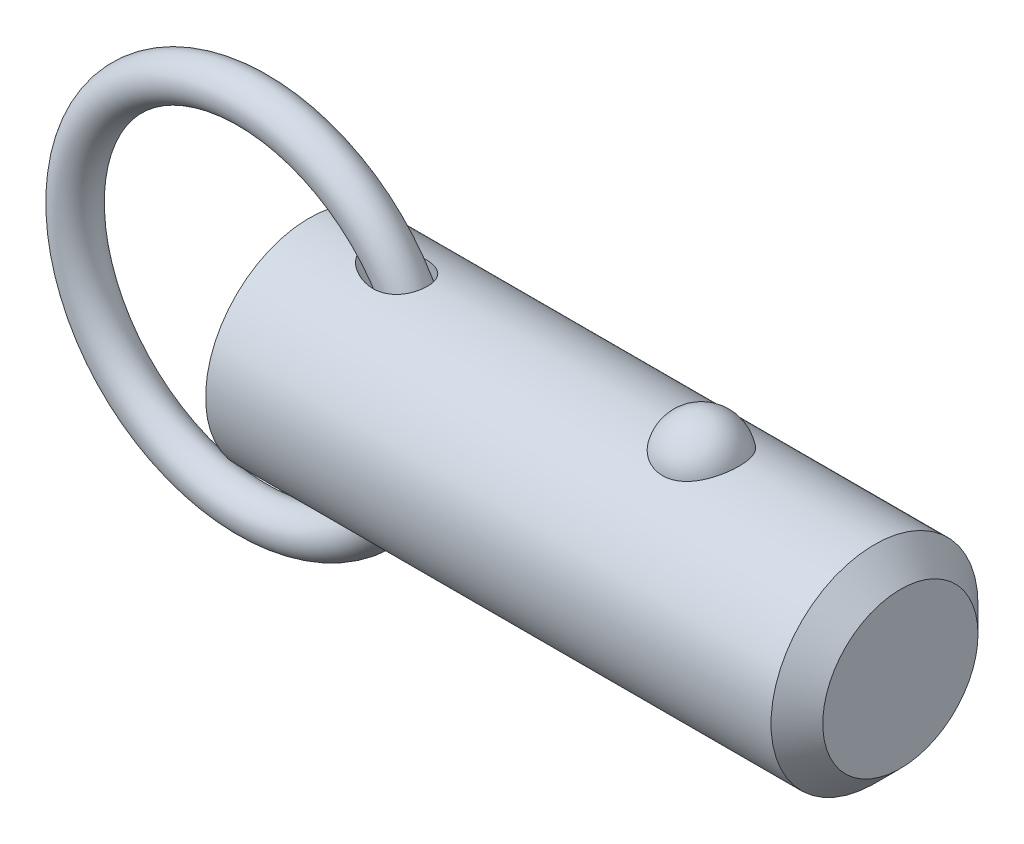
ISO-10303-21;
HEADER;
FILE_DESCRIPTION(('STEP AP214'),'2;1');
FILE_NAME('part.step','',(''),(''),'','','');
FILE_SCHEMA(('AUTOMOTIVE_DESIGN { 1 0 10303 214 1 1 1 1 }'));
ENDSEC;
DATA;
#1=APPLICATION_CONTEXT('core data for automotive mechanical design processes');
#2=APPLICATION_PROTOCOL_DEFINITION('international standard','automotive_design',2000,#1);
#3=PRODUCT_CONTEXT('',#1,'mechanical');
#4=PRODUCT('Part','Part','',(#3));
#5=PRODUCT_RELATED_PRODUCT_CATEGORY('part','',(#4));
#6=PRODUCT_DEFINITION_FORMATION('','',#4);
#7=PRODUCT_DEFINITION_CONTEXT('part definition',#1,'design');
#8=PRODUCT_DEFINITION('design','',#6,#7);
#9=PRODUCT_DEFINITION_SHAPE('','',#8);
#10=(LENGTH_UNIT() NAMED_UNIT(*) SI_UNIT(.MILLI.,.METRE.));
#11=(NAMED_UNIT(*) PLANE_ANGLE_UNIT() SI_UNIT($,.RADIAN.));
#12=(NAMED_UNIT(*) SI_UNIT($,.STERADIAN.) SOLID_ANGLE_UNIT());
#13=UNCERTAINTY_MEASURE_WITH_UNIT(LENGTH_MEASURE(1.E-05),#10,'distance_accuracy_value','');
#14=(GEOMETRIC_REPRESENTATION_CONTEXT(3) GLOBAL_UNCERTAINTY_ASSIGNED_CONTEXT((#13)) GLOBAL_UNIT_ASSIGNED_CONTEXT((#10,
#11,#12)) REPRESENTATION_CONTEXT('',''));
#15=CARTESIAN_POINT('',(0.,0.,0.));
#16=DIRECTION('',(0.,0.,1.));
#17=DIRECTION('',(1.,0.,0.));
#18=AXIS2_PLACEMENT_3D('',#15,#16,#17);
#19=CARTESIAN_POINT('',(-6.08699288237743,0.,0.));
#20=DIRECTION('',(0.,0.,1.));
#21=DIRECTION('',(1.,0.,0.));
#22=AXIS2_PLACEMENT_3D('',#19,#20,#21);
#23=TOROIDAL_SURFACE('',#22,19.05,2.223);
#24=CARTESIAN_POINT('',(15.1860071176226,0.,0.));
#25=VERTEX_POINT('',#24);
#26=VERTEX_LOOP('',#25);
#27=FACE_BOUND('',#26,.T.);
#28=ADVANCED_FACE('P0_F12',(#27),#23,.T.);
#29=CLOSED_SHELL('',(#28));
#30=MANIFOLD_SOLID_BREP('P0_B1',#29);
#31=CARTESIAN_POINT('',(0.,0.,0.));
#32=DIRECTION('',(1.,0.,0.));
#33=DIRECTION('',(0.,0.,-1.));
#34=AXIS2_PLACEMENT_3D('',#31,#32,#33);
#35=CYLINDRICAL_SURFACE('',#34,11.115);
#36=CARTESIAN_POINT('',(6.41405181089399,11.0227946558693,-1.4287136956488));
#37=CARTESIAN_POINT('',(6.49338916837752,11.0115377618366,-1.51556642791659));
#38=CARTESIAN_POINT('',(6.5776546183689,10.9998263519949,-1.59789397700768));
#39=CARTESIAN_POINT('',(6.75386647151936,10.9760304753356,-1.75391400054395));
#40=CARTESIAN_POINT('',(6.84582247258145,10.9639455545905,-1.82759540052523));
#41=CARTESIAN_POINT('',(7.03627827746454,10.9397989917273,-1.96698954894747));
#42=CARTESIAN_POINT('',(7.13480838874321,10.9277377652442,-2.03266078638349));
#43=CARTESIAN_POINT('',(7.33681032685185,10.9041015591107,-2.1558582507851));
#44=CARTESIAN_POINT('',(7.44028007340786,10.8925263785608,-2.21338786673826));
#45=CARTESIAN_POINT('',(7.64386117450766,10.8710104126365,-2.31666528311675));
#46=CARTESIAN_POINT('',(7.74368989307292,10.8610119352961,-2.36295942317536));
#47=CARTESIAN_POINT('',(7.94637195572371,10.8420168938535,-2.44863486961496));
#48=CARTESIAN_POINT('',(8.0492261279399,10.8330206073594,-2.48801426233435));
#49=CARTESIAN_POINT('',(8.3611557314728,10.807980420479,-2.59542730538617));
#50=CARTESIAN_POINT('',(8.57411849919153,10.7938278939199,-2.65299817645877));
#51=CARTESIAN_POINT('',(9.00825016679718,10.7725818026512,-2.73800108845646));
#52=CARTESIAN_POINT('',(9.22947335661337,10.7655491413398,-2.76517330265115));
#53=CARTESIAN_POINT('',(9.6736814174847,10.7605872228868,-2.78445308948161));
#54=CARTESIAN_POINT('',(9.89666486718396,10.7626512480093,-2.77658653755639));
#55=CARTESIAN_POINT('',(10.2950172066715,10.7754452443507,-2.72644436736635));
#56=CARTESIAN_POINT('',(10.4712789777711,10.7844280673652,-2.69109376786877));
#57=CARTESIAN_POINT('',(10.7292776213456,10.8024982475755,-2.61722365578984));
#58=CARTESIAN_POINT('',(10.8142337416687,10.8092901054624,-2.58911576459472));
#59=CARTESIAN_POINT('',(10.9813218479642,10.8242580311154,-2.52581287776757));
#60=CARTESIAN_POINT('',(11.0634550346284,10.8324335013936,-2.49062094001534));
#61=CARTESIAN_POINT('',(11.2247418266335,10.8500287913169,-2.41281958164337));
#62=CARTESIAN_POINT('',(11.3038694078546,10.8594572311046,-2.37015806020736));
#63=CARTESIAN_POINT('',(11.4576781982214,10.8792243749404,-2.27770403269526));
#64=CARTESIAN_POINT('',(11.5323615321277,10.8895626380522,-2.22791497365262));
#65=CARTESIAN_POINT('',(11.6765388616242,10.9108113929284,-2.12140590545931));
#66=CARTESIAN_POINT('',(11.7460329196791,10.9217218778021,-2.064685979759));
#67=CARTESIAN_POINT('',(11.8790597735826,10.9437207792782,-1.94471764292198));
#68=CARTESIAN_POINT('',(11.9425932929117,10.9548091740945,-1.88147002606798));
#69=CARTESIAN_POINT('',(12.109388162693,10.9851999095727,-1.69784918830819));
#70=CARTESIAN_POINT('',(12.205655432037,11.0042655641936,-1.57093023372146));
#71=CARTESIAN_POINT('',(12.374151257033,11.0393391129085,-1.3017676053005));
#72=CARTESIAN_POINT('',(12.4463875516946,11.0553479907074,-1.15952888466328));
#73=CARTESIAN_POINT('',(12.5615818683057,11.0816338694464,-0.871972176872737));
#74=CARTESIAN_POINT('',(12.6058896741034,11.0921698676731,-0.727217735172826));
#75=CARTESIAN_POINT('',(12.6699315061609,11.1075802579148,-0.432089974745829));
#76=CARTESIAN_POINT('',(12.6896681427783,11.1124552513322,-0.281717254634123));
#77=CARTESIAN_POINT('',(12.704022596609,11.1159901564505,0.0188164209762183));
#78=CARTESIAN_POINT('',(12.6988836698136,11.1147102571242,0.168965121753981));
#79=CARTESIAN_POINT('',(12.6641681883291,11.1062126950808,0.46623811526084));
#80=CARTESIAN_POINT('',(12.6345920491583,11.0989951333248,0.613362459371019));
#81=CARTESIAN_POINT('',(12.5517453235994,11.0794095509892,0.90033026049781));
#82=CARTESIAN_POINT('',(12.4984878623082,11.0670443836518,1.04017770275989));
#83=CARTESIAN_POINT('',(12.3696588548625,11.0385082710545,1.308745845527));
#84=CARTESIAN_POINT('',(12.2940887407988,11.0223375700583,1.43746725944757));
#85=CARTESIAN_POINT('',(12.122380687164,10.987872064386,1.68079704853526));
#86=CARTESIAN_POINT('',(12.0261637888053,10.969569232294,1.79534850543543));
#87=CARTESIAN_POINT('',(11.8161707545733,10.932836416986,2.00695695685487));
#88=CARTESIAN_POINT('',(11.7023941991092,10.9144064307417,2.10401353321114));
#89=CARTESIAN_POINT('',(11.4575656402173,10.8788057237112,2.28105326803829));
#90=CARTESIAN_POINT('',(11.3261451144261,10.8616794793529,2.36053412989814));
#91=CARTESIAN_POINT('',(11.0523589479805,10.8308019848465,2.49839044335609));
#92=CARTESIAN_POINT('',(10.9099908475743,10.8170514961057,2.55676113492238));
#93=CARTESIAN_POINT('',(10.6060622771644,10.7929728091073,2.65666105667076));
#94=CARTESIAN_POINT('',(10.4438877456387,10.7830209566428,2.69640163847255));
#95=CARTESIAN_POINT('',(10.1154037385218,10.7687230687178,2.75293129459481));
#96=CARTESIAN_POINT('',(9.94909141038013,10.7643810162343,2.76970406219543));
#97=CARTESIAN_POINT('',(9.54387061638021,10.7604809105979,2.7848723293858));
#98=CARTESIAN_POINT('',(9.30446860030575,10.7637793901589,2.7722775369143));
#99=CARTESIAN_POINT('',(8.94961255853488,10.7757341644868,2.72524141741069));
#100=CARTESIAN_POINT('',(8.83186896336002,10.7808994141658,2.70482239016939));
#101=CARTESIAN_POINT('',(8.59835142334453,10.7932548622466,2.6550999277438));
#102=CARTESIAN_POINT('',(8.48257728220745,10.8004448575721,2.62579738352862));
#103=CARTESIAN_POINT('',(8.2520846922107,10.8166382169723,2.55827624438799));
#104=CARTESIAN_POINT('',(8.1374021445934,10.8256649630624,2.51994155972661));
#105=CARTESIAN_POINT('',(7.91132058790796,10.8451170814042,2.43486475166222));
#106=CARTESIAN_POINT('',(7.79992154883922,10.8555424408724,2.38812270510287));
#107=CARTESIAN_POINT('',(7.58115677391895,10.8774251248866,2.28638483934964));
#108=CARTESIAN_POINT('',(7.47378802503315,10.8888816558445,2.23139534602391));
#109=CARTESIAN_POINT('',(7.26385624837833,10.9124540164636,2.1131026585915));
#110=CARTESIAN_POINT('',(7.16129168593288,10.9245696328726,2.04980214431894));
#111=CARTESIAN_POINT('',(6.91882218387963,10.9543689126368,1.88540538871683));
#112=CARTESIAN_POINT('',(6.7819377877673,10.9721958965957,1.77979827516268));
#113=CARTESIAN_POINT('',(6.52472441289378,11.0070222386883,1.54989693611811));
#114=CARTESIAN_POINT('',(6.40436902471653,11.0240228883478,1.42563320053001));
#115=CARTESIAN_POINT('',(6.21838804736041,11.0509658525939,1.19529359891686));
#116=CARTESIAN_POINT('',(6.14691885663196,11.0615430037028,1.09404520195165));
#117=CARTESIAN_POINT('',(6.0204349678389,11.0805004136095,0.881508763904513));
#118=CARTESIAN_POINT('',(5.96539400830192,11.0888841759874,0.770237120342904));
#119=CARTESIAN_POINT('',(5.88475453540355,11.1012553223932,0.560577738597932));
#120=CARTESIAN_POINT('',(5.85559643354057,11.1057686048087,0.46360392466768));
#121=CARTESIAN_POINT('',(5.81381299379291,11.1122523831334,0.266083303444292));
#122=CARTESIAN_POINT('',(5.80117118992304,11.1142254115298,0.165540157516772));
#123=CARTESIAN_POINT('',(5.79363815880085,11.1153999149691,-0.0364747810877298));
#124=CARTESIAN_POINT('',(5.79878799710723,11.1145949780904,-0.137948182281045));
#125=CARTESIAN_POINT('',(5.82639592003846,11.1102987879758,-0.338493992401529));
#126=CARTESIAN_POINT('',(5.8488723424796,11.1068046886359,-0.437563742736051));
#127=CARTESIAN_POINT('',(5.91510741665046,11.0965857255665,-0.649968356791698));
#128=CARTESIAN_POINT('',(5.96220905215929,11.0893566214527,-0.762222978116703));
#129=CARTESIAN_POINT('',(6.0737844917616,11.072471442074,-0.977396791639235));
#130=CARTESIAN_POINT('',(6.13826787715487,11.0628140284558,-1.08031079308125));
#131=CARTESIAN_POINT('',(6.24101077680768,11.0477136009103,-1.2219580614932));
#132=CARTESIAN_POINT('',(6.27403486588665,11.042895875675,-1.26469183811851));
#133=CARTESIAN_POINT('',(6.34238022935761,11.0330152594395,-1.34817011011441));
#134=CARTESIAN_POINT('',(6.37769867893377,11.0279526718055,-1.38891694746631));
#135=CARTESIAN_POINT('',(6.41405181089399,11.0227946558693,-1.4287136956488));
#136=B_SPLINE_CURVE_WITH_KNOTS('',3,(#36,#37,#38,#39,#40,#41,#42,#43,#44,#45,#46,#47,#48,#49,
#50,#51,#52,#53,#54,#55,#56,#57,#58,#59,#60,#61,#62,#63,#64,#65,#66,#67,#68,#69,#70,#71,#72,#73,
#74,#75,#76,#77,#78,#79,#80,#81,#82,#83,#84,#85,#86,#87,#88,#89,#90,#91,#92,#93,#94,#95,#96,#97,
#98,#99,#100,#101,#102,#103,#104,#105,#106,#107,#108,#109,#110,#111,#112,#113,#114,#115,#116,
#117,#118,#119,#120,#121,#122,#123,#124,#125,#126,#127,#128,#129,#130,#131,#132,#133,#134,#135),
.UNSPECIFIED.,.T.,.F.,(4,2,2,2,2,2,2,2,2,2,2,2,2,2,2,2,2,2,2,2,2,2,2,2,2,2,2,2,2,2,2,2,2,2,2,2,
2,2,2,2,2,2,2,2,2,2,2,2,2,4),(0.,0.354433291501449,0.709315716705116,1.0659654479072,
1.42246628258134,1.75367157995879,2.08496839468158,2.74582009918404,3.41227815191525,
4.07824412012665,4.61583787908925,4.88478112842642,5.1536085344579,5.42439170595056,
5.69504436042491,5.96569375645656,6.23631025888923,6.7149072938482,7.1933500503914,
7.6464143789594,8.09943057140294,8.54802575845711,8.99661331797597,9.44495256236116,
9.89326303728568,10.3433195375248,10.7933867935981,11.2550086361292,11.7167345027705,
12.2165866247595,12.7167934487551,13.4318876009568,13.7904664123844,14.1490092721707,
14.5124394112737,14.8758662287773,15.239015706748,15.6020483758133,16.1219860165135,
16.6410830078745,17.0130520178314,17.3844231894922,17.6872330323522,17.9897407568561,
18.2929471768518,18.5964749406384,18.9603532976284,19.3244326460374,19.4870338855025,
19.649438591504),.UNSPECIFIED.);
#137=CARTESIAN_POINT('',(6.41405181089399,11.0227946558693,-1.4287136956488));
#138=VERTEX_POINT('',#137);
#139=EDGE_CURVE('P1_E40',#138,#138,#136,.T.);
#140=ORIENTED_EDGE('',*,*,#139,.T.);
#141=EDGE_LOOP('',(#140));
#142=FACE_BOUND('',#141,.T.);
#143=CARTESIAN_POINT('',(60.72125,0.,0.));
#144=DIRECTION('',(1.,0.,0.));
#145=DIRECTION('',(0.,0.,-1.));
#146=AXIS2_PLACEMENT_3D('',#143,#144,#145);
#147=CIRCLE('',#146,11.115);
#148=CARTESIAN_POINT('',(60.72125,0.,-11.115));
#149=VERTEX_POINT('',#148);
#150=EDGE_CURVE('P1_E25',#149,#149,#147,.T.);
#151=ORIENTED_EDGE('',*,*,#150,.F.);
#152=EDGE_LOOP('',(#151));
#153=FACE_BOUND('',#152,.T.);
#154=CARTESIAN_POINT('',(0.,0.,0.));
#155=DIRECTION('',(1.,0.,0.));
#156=DIRECTION('',(0.,0.,-1.));
#157=AXIS2_PLACEMENT_3D('',#154,#155,#156);
#158=CIRCLE('',#157,11.115);
#159=CARTESIAN_POINT('',(0.,0.,-11.115));
#160=VERTEX_POINT('',#159);
#161=EDGE_CURVE('P1_E9',#160,#160,#158,.T.);
#162=ORIENTED_EDGE('',*,*,#161,.T.);
#163=EDGE_LOOP('',(#162));
#164=FACE_BOUND('',#163,.T.);
#165=CARTESIAN_POINT('',(42.1310680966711,10.3028087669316,4.17077409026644));
#166=CARTESIAN_POINT('',(41.9147756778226,10.3028003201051,4.17078240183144));
#167=CARTESIAN_POINT('',(41.6985488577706,10.3098895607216,4.15340593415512));
#168=CARTESIAN_POINT('',(41.2725408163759,10.3373834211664,4.08449540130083));
#169=CARTESIAN_POINT('',(41.0627577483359,10.3577841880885,4.03297121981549));
#170=CARTESIAN_POINT('',(40.6557825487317,10.4095237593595,3.89746513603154));
#171=CARTESIAN_POINT('',(40.4585726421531,10.4408466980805,3.8135302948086));
#172=CARTESIAN_POINT('',(40.0813382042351,10.5110236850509,3.61560339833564));
#173=CARTESIAN_POINT('',(39.9013171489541,10.5498792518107,3.50160528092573));
#174=CARTESIAN_POINT('',(39.5576842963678,10.6322884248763,3.2429246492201));
#175=CARTESIAN_POINT('',(39.3946861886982,10.6759443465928,3.09746040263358));
#176=CARTESIAN_POINT('',(39.0945911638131,10.7625291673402,2.78171925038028));
#177=CARTESIAN_POINT('',(38.9574990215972,10.8054579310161,2.61143778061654));
#178=CARTESIAN_POINT('',(38.7064084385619,10.8881935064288,2.24226695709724));
#179=CARTESIAN_POINT('',(38.5937105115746,10.9277761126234,2.04244123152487));
#180=CARTESIAN_POINT('',(38.4017771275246,10.997484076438,1.62578254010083));
#181=CARTESIAN_POINT('',(38.322544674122,11.0276085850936,1.40894804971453));
#182=CARTESIAN_POINT('',(38.1983034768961,11.0756732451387,0.961250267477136));
#183=CARTESIAN_POINT('',(38.153760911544,11.0934470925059,0.73023943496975));
#184=CARTESIAN_POINT('',(38.1015695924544,11.1143331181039,0.263439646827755));
#185=CARTESIAN_POINT('',(38.0939200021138,11.1174456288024,0.027650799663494));
#186=CARTESIAN_POINT('',(38.1156105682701,11.1087161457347,-0.440729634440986));
#187=CARTESIAN_POINT('',(38.1447624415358,11.0969502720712,-0.673331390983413));
#188=CARTESIAN_POINT('',(38.2391432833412,11.0597872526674,-1.12996621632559));
#189=CARTESIAN_POINT('',(38.3043729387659,11.0343898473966,-1.35399912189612));
#190=CARTESIAN_POINT('',(38.4696984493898,10.972515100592,-1.78750286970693));
#191=CARTESIAN_POINT('',(38.5698386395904,10.9360236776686,-1.99695478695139));
#192=CARTESIAN_POINT('',(38.8029408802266,10.8557595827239,-2.39520667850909));
#193=CARTESIAN_POINT('',(38.9359054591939,10.8119863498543,-2.5840050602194));
#194=CARTESIAN_POINT('',(39.232407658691,10.7216733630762,-2.93635726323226));
#195=CARTESIAN_POINT('',(39.3960565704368,10.675123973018,-3.09981510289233));
#196=CARTESIAN_POINT('',(39.7498601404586,10.5846571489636,-3.39592247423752));
#197=CARTESIAN_POINT('',(39.9400123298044,10.5407394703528,-3.52857487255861));
#198=CARTESIAN_POINT('',(40.3375014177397,10.4616690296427,-3.75646057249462));
#199=CARTESIAN_POINT('',(40.5443670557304,10.4263443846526,-3.8524543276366));
#200=CARTESIAN_POINT('',(40.9729541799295,10.3675574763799,-4.00798747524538));
#201=CARTESIAN_POINT('',(41.194670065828,10.344090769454,-4.0675405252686));
#202=CARTESIAN_POINT('',(41.6346695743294,10.3128282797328,-4.14614314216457));
#203=CARTESIAN_POINT('',(41.8525654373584,10.3043040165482,-4.16707833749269));
#204=CARTESIAN_POINT('',(42.2889495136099,10.3016771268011,-4.17357158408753));
#205=CARTESIAN_POINT('',(42.5074376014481,10.3075716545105,-4.15913661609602));
#206=CARTESIAN_POINT('',(42.9317442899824,10.3326686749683,-4.09636961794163));
#207=CARTESIAN_POINT('',(43.1377458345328,10.3514555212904,-4.04909574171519));
#208=CARTESIAN_POINT('',(43.5385764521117,10.399818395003,-3.92320197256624));
#209=CARTESIAN_POINT('',(43.7334046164,10.4293952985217,-3.84457953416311));
#210=CARTESIAN_POINT('',(44.1111917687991,10.4969600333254,-3.65612410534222));
#211=CARTESIAN_POINT('',(44.2937974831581,10.5351178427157,-3.54564545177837));
#212=CARTESIAN_POINT('',(44.6382040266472,10.6154999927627,-3.29718036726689));
#213=CARTESIAN_POINT('',(44.800000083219,10.657725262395,-3.15918764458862));
#214=CARTESIAN_POINT('',(45.1069596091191,10.744212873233,-2.85163580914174));
#215=CARTESIAN_POINT('',(45.2508919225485,10.7884718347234,-2.68084605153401));
#216=CARTESIAN_POINT('',(45.5092371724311,10.872374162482,-2.3172186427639));
#217=CARTESIAN_POINT('',(45.6236448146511,10.9120167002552,-2.12437704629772));
#218=CARTESIAN_POINT('',(45.8238739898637,10.9838919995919,-1.71516999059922));
#219=CARTESIAN_POINT('',(45.9086617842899,11.0158465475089,-1.498248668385));
#220=CARTESIAN_POINT('',(46.0426838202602,11.0673523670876,-1.05228572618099));
#221=CARTESIAN_POINT('',(46.0919174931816,11.086903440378,-0.82324391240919));
#222=CARTESIAN_POINT('',(46.1538915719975,11.1116323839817,-0.359087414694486));
#223=CARTESIAN_POINT('',(46.1665662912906,11.1167843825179,-0.123962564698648));
#224=CARTESIAN_POINT('',(46.154973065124,11.1121144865,0.345220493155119));
#225=CARTESIAN_POINT('',(46.1307056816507,11.1022928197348,0.579278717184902));
#226=CARTESIAN_POINT('',(46.0459073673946,11.0687504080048,1.03866534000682));
#227=CARTESIAN_POINT('',(45.9855299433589,11.0450885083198,1.26402641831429));
#228=CARTESIAN_POINT('',(45.8298532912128,10.9863185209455,1.70076772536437));
#229=CARTESIAN_POINT('',(45.734551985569,10.9512097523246,1.91214712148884));
#230=CARTESIAN_POINT('',(45.5103974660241,10.8729733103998,2.31608359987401));
#231=CARTESIAN_POINT('',(45.3813806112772,10.8298068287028,2.50854240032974));
#232=CARTESIAN_POINT('',(45.0927327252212,10.7401896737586,2.86808766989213));
#233=CARTESIAN_POINT('',(44.9331022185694,10.6937390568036,3.03517457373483));
#234=CARTESIAN_POINT('',(44.5875341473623,10.6029321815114,3.33857581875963));
#235=CARTESIAN_POINT('',(44.4017089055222,10.5585680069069,3.47501541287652));
#236=CARTESIAN_POINT('',(44.0078750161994,10.4769321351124,3.71390897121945));
#237=CARTESIAN_POINT('',(43.7998635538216,10.439661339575,3.81635861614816));
#238=CARTESIAN_POINT('',(43.3540666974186,10.3749407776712,3.98910631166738));
#239=CARTESIAN_POINT('',(43.1152342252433,10.3482457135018,4.05700929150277));
#240=CARTESIAN_POINT('',(42.6279254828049,10.312188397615,4.14782844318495));
#241=CARTESIAN_POINT('',(42.3794535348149,10.3028184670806,4.17076454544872));
#242=CARTESIAN_POINT('',(42.1310680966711,10.3028087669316,4.17077409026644));
#243=B_SPLINE_CURVE_WITH_KNOTS('',3,(#165,#166,#167,#168,#169,#170,#171,#172,#173,#174,#175,
#176,#177,#178,#179,#180,#181,#182,#183,#184,#185,#186,#187,#188,#189,#190,#191,#192,#193,#194,
#195,#196,#197,#198,#199,#200,#201,#202,#203,#204,#205,#206,#207,#208,#209,#210,#211,#212,#213,
#214,#215,#216,#217,#218,#219,#220,#221,#222,#223,#224,#225,#226,#227,#228,#229,#230,#231,#232,
#233,#234,#235,#236,#237,#238,#239,#240,#241,#242),.UNSPECIFIED.,.T.,.F.,(4,2,2,2,2,2,2,2,2,2,2,
2,2,2,2,2,2,2,2,2,2,2,2,2,2,2,2,2,2,2,2,2,2,2,2,2,2,2,4),(0.,0.647966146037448,1.29574482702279,
1.94258643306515,2.58955857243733,3.25496465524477,3.92049326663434,4.61566368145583,
5.31089647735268,6.01531821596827,6.71972398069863,7.42054043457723,8.12137023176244,
8.8230933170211,9.52487047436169,10.2292439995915,10.9335519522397,11.6223330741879,
12.3108558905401,12.9647664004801,13.6185478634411,14.252184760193,14.8858731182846,
15.5334360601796,16.1811472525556,16.8611459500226,17.5412664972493,18.2431855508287,
18.9451158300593,19.6483065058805,20.3514864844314,21.0516982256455,21.7519516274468,
22.4556690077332,23.1593743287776,23.860149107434,24.5610129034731,25.3054529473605,
26.049562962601),.UNSPECIFIED.);
#244=CARTESIAN_POINT('',(42.1310680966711,10.3028087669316,4.17077409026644));
#245=VERTEX_POINT('',#244);
#246=EDGE_CURVE('P1_E34',#245,#245,#243,.T.);
#247=ORIENTED_EDGE('',*,*,#246,.T.);
#248=EDGE_LOOP('',(#247));
#249=FACE_BOUND('',#248,.T.);
#250=CARTESIAN_POINT('',(6.41405181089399,-11.0227946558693,-1.4287136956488));
#251=CARTESIAN_POINT('',(6.3312406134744,-11.0345445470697,-1.33806125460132));
#252=CARTESIAN_POINT('',(6.25372866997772,-11.0458090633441,-1.24240732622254));
#253=CARTESIAN_POINT('',(6.11277905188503,-11.0666115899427,-1.04095704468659));
#254=CARTESIAN_POINT('',(6.04933920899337,-11.0761498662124,-0.935162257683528));
#255=CARTESIAN_POINT('',(5.94029181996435,-11.0927063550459,-0.712476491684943));
#256=CARTESIAN_POINT('',(5.89492964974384,-11.0996897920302,-0.595457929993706));
#257=CARTESIAN_POINT('',(5.84498161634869,-11.1074141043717,-0.414997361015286));
#258=CARTESIAN_POINT('',(5.83135004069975,-11.1095300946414,-0.354047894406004));
#259=CARTESIAN_POINT('',(5.81051649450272,-11.1127688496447,-0.231041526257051));
#260=CARTESIAN_POINT('',(5.80331311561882,-11.1138918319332,-0.168984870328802));
#261=CARTESIAN_POINT('',(5.7929652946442,-11.1155042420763,-0.000484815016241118));
#262=CARTESIAN_POINT('',(5.79625267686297,-11.1149904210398,0.106437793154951));
#263=CARTESIAN_POINT('',(5.82213676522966,-11.1109609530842,0.317809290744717));
#264=CARTESIAN_POINT('',(5.84474662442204,-11.1074432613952,0.422256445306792));
#265=CARTESIAN_POINT('',(5.911131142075,-11.097197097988,0.639361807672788));
#266=CARTESIAN_POINT('',(5.95733120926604,-11.090102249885,0.751250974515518));
#267=CARTESIAN_POINT('',(6.06709542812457,-11.0734770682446,0.965912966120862));
#268=CARTESIAN_POINT('',(6.13068735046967,-11.06394284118,1.06867085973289));
#269=CARTESIAN_POINT('',(6.30294237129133,-11.0385920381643,1.30890635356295));
#270=CARTESIAN_POINT('',(6.41896200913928,-11.0218881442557,1.44097376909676));
#271=CARTESIAN_POINT('',(6.6698965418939,-10.9871512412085,1.68553954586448));
#272=CARTESIAN_POINT('',(6.80485520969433,-10.9691152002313,1.79799117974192));
#273=CARTESIAN_POINT('',(7.04881236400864,-10.9382283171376,1.97587596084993));
#274=CARTESIAN_POINT('',(7.15465712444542,-10.9253240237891,2.04570822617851));
#275=CARTESIAN_POINT('',(7.37202504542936,-10.9000987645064,2.17611840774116));
#276=CARTESIAN_POINT('',(7.48355057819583,-10.8877780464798,2.23669241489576));
#277=CARTESIAN_POINT('',(7.71132418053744,-10.8641580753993,2.34873831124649));
#278=CARTESIAN_POINT('',(7.82757727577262,-10.8528599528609,2.40020018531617));
#279=CARTESIAN_POINT('',(8.06386825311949,-10.8317234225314,2.49385169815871));
#280=CARTESIAN_POINT('',(8.18390558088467,-10.8218848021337,2.53604268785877));
#281=CARTESIAN_POINT('',(8.42918336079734,-10.8039208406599,2.61152283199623));
#282=CARTESIAN_POINT('',(8.55447802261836,-10.7958283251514,2.64464414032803));
#283=CARTESIAN_POINT('',(8.80752127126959,-10.781995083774,2.70048793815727));
#284=CARTESIAN_POINT('',(8.93527019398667,-10.7762546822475,2.72320899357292));
#285=CARTESIAN_POINT('',(9.1921017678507,-10.7675291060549,2.75750994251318));
#286=CARTESIAN_POINT('',(9.32118105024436,-10.7645381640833,2.76911315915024));
#287=CARTESIAN_POINT('',(9.57984338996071,-10.761622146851,2.78042035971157));
#288=CARTESIAN_POINT('',(9.70942621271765,-10.7616957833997,2.78012934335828));
#289=CARTESIAN_POINT('',(10.0243125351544,-10.7659059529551,2.76381534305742));
#290=CARTESIAN_POINT('',(10.209307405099,-10.7717977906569,2.74099674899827));
#291=CARTESIAN_POINT('',(10.5731188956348,-10.7905408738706,2.66626238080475));
#292=CARTESIAN_POINT('',(10.7519389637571,-10.8033881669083,2.61436313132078));
#293=CARTESIAN_POINT('',(11.0114289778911,-10.8271584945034,2.51336808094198));
#294=CARTESIAN_POINT('',(11.096831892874,-10.835881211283,2.47562331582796));
#295=CARTESIAN_POINT('',(11.2636000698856,-10.8545688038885,2.39236170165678));
#296=CARTESIAN_POINT('',(11.3449673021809,-10.8645330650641,2.3468486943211));
#297=CARTESIAN_POINT('',(11.5027832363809,-10.8853818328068,2.24815967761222));
#298=CARTESIAN_POINT('',(11.5792327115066,-10.8962661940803,2.19498487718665));
#299=CARTESIAN_POINT('',(11.7263315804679,-10.9185541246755,2.08128855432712));
#300=CARTESIAN_POINT('',(11.7969818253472,-10.9299576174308,2.02076811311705));
#301=CARTESIAN_POINT('',(11.9817953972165,-10.9613645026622,1.84513663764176));
#302=CARTESIAN_POINT('',(12.0893012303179,-10.9814643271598,1.72286660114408));
#303=CARTESIAN_POINT('',(12.2803576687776,-11.0193991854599,1.46066991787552));
#304=CARTESIAN_POINT('',(12.3639173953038,-11.0372350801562,1.3207500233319));
#305=CARTESIAN_POINT('',(12.4996220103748,-11.0672969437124,1.03778067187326));
#306=CARTESIAN_POINT('',(12.5535315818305,-11.0798242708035,0.895607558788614));
#307=CARTESIAN_POINT('',(12.636874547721,-11.0995427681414,0.603918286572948));
#308=CARTESIAN_POINT('',(12.6663115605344,-11.1067347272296,0.454403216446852));
#309=CARTESIAN_POINT('',(12.6997387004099,-11.1149224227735,0.154577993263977));
#310=CARTESIAN_POINT('',(12.7040886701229,-11.1160057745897,0.00431019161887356));
#311=CARTESIAN_POINT('',(12.6882048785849,-11.1120956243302,-0.294841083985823));
#312=CARTESIAN_POINT('',(12.6679715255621,-11.1071022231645,-0.443724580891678));
#313=CARTESIAN_POINT('',(12.6034470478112,-11.0915888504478,-0.7356882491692));
#314=CARTESIAN_POINT('',(12.5591858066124,-11.0810757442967,-0.878775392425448));
#315=CARTESIAN_POINT('',(12.4477416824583,-11.0556687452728,-1.15529525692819));
#316=CARTESIAN_POINT('',(12.3805601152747,-11.0407751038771,-1.2887285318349));
#317=CARTESIAN_POINT('',(12.2248919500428,-11.0081839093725,-1.54257976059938));
#318=CARTESIAN_POINT('',(12.1363549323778,-10.9904797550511,-1.66296592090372));
#319=CARTESIAN_POINT('',(11.9406137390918,-10.9541951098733,-1.88726577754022));
#320=CARTESIAN_POINT('',(11.833409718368,-10.9356146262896,-1.99117961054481));
#321=CARTESIAN_POINT('',(11.601318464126,-10.8991360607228,-2.18213646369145));
#322=CARTESIAN_POINT('',(11.4761325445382,-10.8812577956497,-2.26881927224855));
#323=CARTESIAN_POINT('',(11.2134852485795,-10.8482871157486,-2.42157282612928));
#324=CARTESIAN_POINT('',(11.0760218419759,-10.8331951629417,-2.48764015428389));
#325=CARTESIAN_POINT('',(10.7828968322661,-10.8061050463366,-2.60290068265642));
#326=CARTESIAN_POINT('',(10.6266338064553,-10.7943907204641,-2.65062248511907));
#327=CARTESIAN_POINT('',(10.3086617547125,-10.7762429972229,-2.72345054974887));
#328=CARTESIAN_POINT('',(10.146948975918,-10.7698133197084,-2.74854088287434));
#329=CARTESIAN_POINT('',(9.75541304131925,-10.7608036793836,-2.78368719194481));
#330=CARTESIAN_POINT('',(9.52459435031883,-10.7608467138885,-2.78350276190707));
#331=CARTESIAN_POINT('',(9.0660496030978,-10.7702674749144,-2.74677945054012));
#332=CARTESIAN_POINT('',(8.83832966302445,-10.7796615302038,-2.71017697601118));
#333=CARTESIAN_POINT('',(8.38783466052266,-10.8058248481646,-2.60392490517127));
#334=CARTESIAN_POINT('',(8.16517101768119,-10.8226939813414,-2.53382676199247));
#335=CARTESIAN_POINT('',(7.84087311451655,-10.8516548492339,-2.40555545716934));
#336=CARTESIAN_POINT('',(7.73435551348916,-10.8619221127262,-2.35892455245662));
#337=CARTESIAN_POINT('',(7.52510420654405,-10.883357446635,-2.25797017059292));
#338=CARTESIAN_POINT('',(7.42236986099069,-10.8945253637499,-2.20364800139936));
#339=CARTESIAN_POINT('',(7.23808758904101,-10.915528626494,-2.09688018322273));
#340=CARTESIAN_POINT('',(7.15584631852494,-10.9252787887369,-2.0456107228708));
#341=CARTESIAN_POINT('',(6.99510576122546,-10.944960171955,-1.93754729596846));
#342=CARTESIAN_POINT('',(6.91660574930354,-10.9548913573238,-1.88075440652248));
#343=CARTESIAN_POINT('',(6.76418133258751,-10.974690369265,-1.76154504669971));
#344=CARTESIAN_POINT('',(6.69024940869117,-10.9845582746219,-1.6991382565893));
#345=CARTESIAN_POINT('',(6.54780119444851,-11.0039826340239,-1.56842485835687));
#346=CARTESIAN_POINT('',(6.47928247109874,-11.0135392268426,-1.50012092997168));
#347=CARTESIAN_POINT('',(6.41405181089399,-11.0227946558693,-1.4287136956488));
#348=B_SPLINE_CURVE_WITH_KNOTS('',3,(#250,#251,#252,#253,#254,#255,#256,#257,#258,#259,#260,
#261,#262,#263,#264,#265,#266,#267,#268,#269,#270,#271,#272,#273,#274,#275,#276,#277,#278,#279,
#280,#281,#282,#283,#284,#285,#286,#287,#288,#289,#290,#291,#292,#293,#294,#295,#296,#297,#298,
#299,#300,#301,#302,#303,#304,#305,#306,#307,#308,#309,#310,#311,#312,#313,#314,#315,#316,#317,
#318,#319,#320,#321,#322,#323,#324,#325,#326,#327,#328,#329,#330,#331,#332,#333,#334,#335,#336,
#337,#338,#339,#340,#341,#342,#343,#344,#345,#346,#347),.UNSPECIFIED.,.T.,.F.,(4,2,2,2,2,2,2,2,
2,2,2,2,2,2,2,2,2,2,2,2,2,2,2,2,2,2,2,2,2,2,2,2,2,2,2,2,2,2,2,2,2,2,2,2,2,2,2,2,4),(0.,
0.369835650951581,0.739614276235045,1.1142538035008,1.30141910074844,1.48854338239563,
1.8074587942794,2.12659146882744,2.4883888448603,2.85076733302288,3.3776216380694,
3.90571433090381,4.287639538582,4.66972556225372,5.05222896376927,5.43467659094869,
5.82378546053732,6.21294796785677,6.6012922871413,6.9894733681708,7.54669558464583,
8.10360148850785,8.38458539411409,8.66543074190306,8.94623182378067,9.22699162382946,
9.7162888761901,10.2053995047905,10.6608871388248,11.1163074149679,11.5651786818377,
12.0140424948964,12.4623493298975,12.9106304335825,13.3599804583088,13.8093267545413,
14.2672570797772,14.7252632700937,15.214740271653,15.7045615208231,16.3932594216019,
17.083162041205,17.7825738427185,18.1325177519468,18.4824022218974,18.7744056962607,
19.0663523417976,19.3578048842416,19.6491256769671),.UNSPECIFIED.);
#349=CARTESIAN_POINT('',(6.41405181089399,-11.0227946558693,-1.4287136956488));
#350=VERTEX_POINT('',#349);
#351=EDGE_CURVE('P1_E17',#350,#350,#348,.T.);
#352=ORIENTED_EDGE('',*,*,#351,.T.);
#353=EDGE_LOOP('',(#352));
#354=FACE_BOUND('',#353,.T.);
#355=ADVANCED_FACE('P1_F13',(#142,#153,#164,#249,#354),#35,.T.);
#356=CARTESIAN_POINT('',(0.,0.,0.));
#357=DIRECTION('',(-1.,0.,0.));
#358=DIRECTION('',(0.,0.,1.));
#359=AXIS2_PLACEMENT_3D('',#356,#357,#358);
#360=PLANE('',#359);
#361=ORIENTED_EDGE('',*,*,#161,.F.);
#362=EDGE_LOOP('',(#361));
#363=FACE_BOUND('',#362,.T.);
#364=ADVANCED_FACE('P1_F15',(#363),#360,.T.);
#365=CARTESIAN_POINT('',(63.5,0.,0.));
#366=DIRECTION('',(-1.,0.,0.));
#367=DIRECTION('',(0.,0.,1.));
#368=AXIS2_PLACEMENT_3D('',#365,#366,#367);
#369=CONICAL_SURFACE('',#368,8.33625000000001,0.785398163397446);
#370=ORIENTED_EDGE('',*,*,#150,.T.);
#371=EDGE_LOOP('',(#370));
#372=FACE_BOUND('',#371,.T.);
#373=CARTESIAN_POINT('',(63.5,0.,0.));
#374=DIRECTION('',(1.,0.,0.));
#375=DIRECTION('',(0.,0.,-1.));
#376=AXIS2_PLACEMENT_3D('',#373,#374,#375);
#377=CIRCLE('',#376,8.33625000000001);
#378=CARTESIAN_POINT('',(63.5,0.,-8.33625000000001));
#379=VERTEX_POINT('',#378);
#380=EDGE_CURVE('P1_E30',#379,#379,#377,.T.);
#381=ORIENTED_EDGE('',*,*,#380,.F.);
#382=EDGE_LOOP('',(#381));
#383=FACE_BOUND('',#382,.T.);
#384=ADVANCED_FACE('P1_F55',(#372,#383),#369,.T.);
#385=CARTESIAN_POINT('',(63.5,8.33625000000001,0.));
#386=DIRECTION('',(1.,0.,0.));
#387=DIRECTION('',(0.,0.,-1.));
#388=AXIS2_PLACEMENT_3D('',#385,#386,#387);
#389=PLANE('',#388);
#390=ORIENTED_EDGE('',*,*,#380,.T.);
#391=EDGE_LOOP('',(#390));
#392=FACE_BOUND('',#391,.T.);
#393=ADVANCED_FACE('P1_F51',(#392),#389,.T.);
#394=CARTESIAN_POINT('',(42.1310680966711,10.0035,0.));
#395=DIRECTION('',(-1.,0.,0.));
#396=DIRECTION('',(0.,1.,0.));
#397=AXIS2_PLACEMENT_3D('',#394,#395,#396);
#398=SPHERICAL_SURFACE('',#397,4.1815);
#399=ORIENTED_EDGE('',*,*,#246,.F.);
#400=EDGE_LOOP('',(#399));
#401=FACE_BOUND('',#400,.T.);
#402=ADVANCED_FACE('P1_F46',(#401),#398,.T.);
#403=CARTESIAN_POINT('',(-6.08699288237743,0.,0.));
#404=DIRECTION('',(0.,0.,1.));
#405=DIRECTION('',(1.,0.,0.));
#406=AXIS2_PLACEMENT_3D('',#403,#404,#405);
#407=TOROIDAL_SURFACE('',#406,19.05,2.77875);
#408=ORIENTED_EDGE('',*,*,#351,.F.);
#409=EDGE_LOOP('',(#408));
#410=FACE_BOUND('',#409,.T.);
#411=ORIENTED_EDGE('',*,*,#139,.F.);
#412=EDGE_LOOP('',(#411));
#413=FACE_BOUND('',#412,.T.);
#414=ADVANCED_FACE('P1_F50',(#410,#413),#407,.F.);
#415=CLOSED_SHELL('',(#355,#364,#384,#393,#402,#414));
#416=MANIFOLD_SOLID_BREP('P1_B1',#415);
#417=ADVANCED_BREP_SHAPE_REPRESENTATION('',(#18,#30,#416),#14);
#418=SHAPE_DEFINITION_REPRESENTATION(#9,#417);
ENDSEC;
END-ISO-10303-21;
